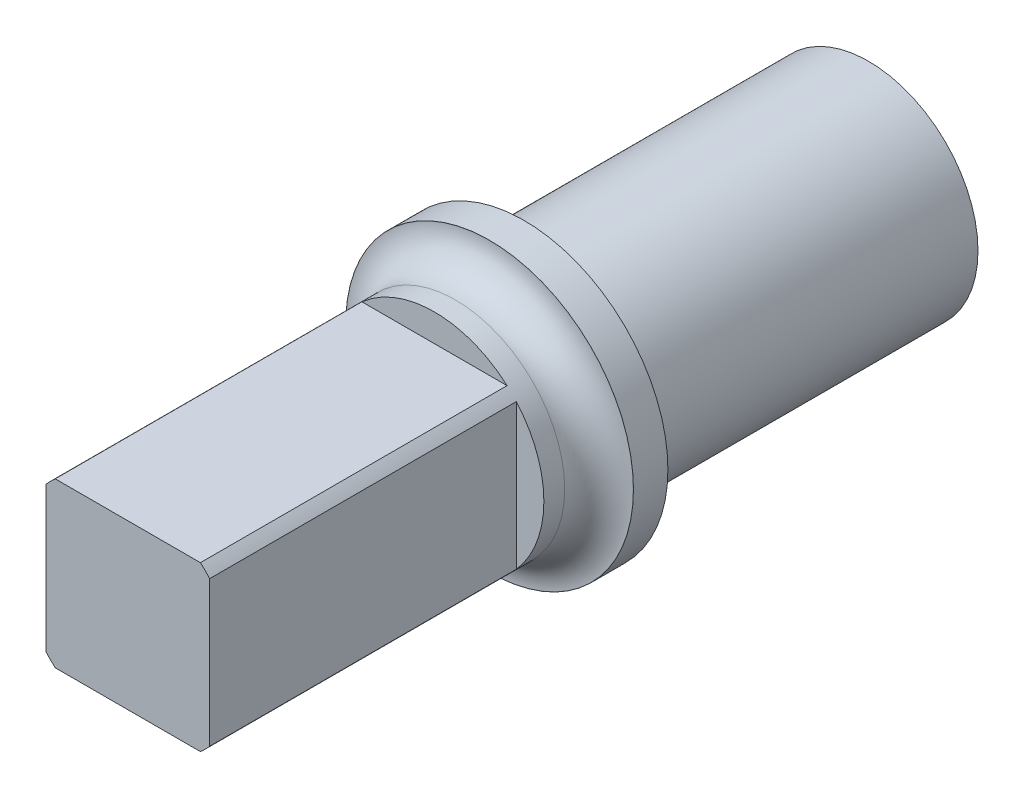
from build123d import *

# Parameters (mm, degrees)
SKETCH_3_OUTSIDE_W   = 28.512
SKETCH_3_OUTSIDE_H   = 28.512
SKETCH_3_OUTSIDE_W_2 = 9.5
SKETCH_3_OUTSIDE_H_2 = 9.5
CUT_EXTRUDE_1_DEPTH  = 17.8


with BuildPart() as part:
    # Sketch 1 → Revolve 2 (revolve)
    with BuildSketch(Plane(origin=(0, 0, 0), x_dir=(0, 0, -1), z_dir=(1, 0, 0)), mode=Mode.PRIVATE) as revolve_2_sk:
        with BuildLine():
            Line((0, 0), (43, 0))
            Line((43, 0), (43, 6.35))
            Line((43, 6.35), (23, 6.35))
            Line((23, 6.35), (23, 8.35))
            Line((23, 8.35), (21, 8.35))
            Line((21, 8.35), (21, 8.34))
            ThreePointArc((21, 8.34), (20.417142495, 6.932857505), (19.01, 6.35))
            Line((19.01, 6.35), (0, 6.35))
            Line((0, 6.35), (0, 0))
        make_face()
    revolve(revolve_2_sk.sketch.rotate(Axis((0, 0, 0), (0, 0, -1)), 90), axis=Axis((0, 0, 0), (0, 0, -1)))

    # Sketch 3 outside → Cut-Extrude 1 (cut)
    with BuildSketch(Plane.XY):
        Rectangle(SKETCH_3_OUTSIDE_W, SKETCH_3_OUTSIDE_H)
        Rectangle(SKETCH_3_OUTSIDE_W_2, SKETCH_3_OUTSIDE_H_2, mode=Mode.SUBTRACT)
    extrude(amount=-CUT_EXTRUDE_1_DEPTH, mode=Mode.SUBTRACT)


solid = part.part
